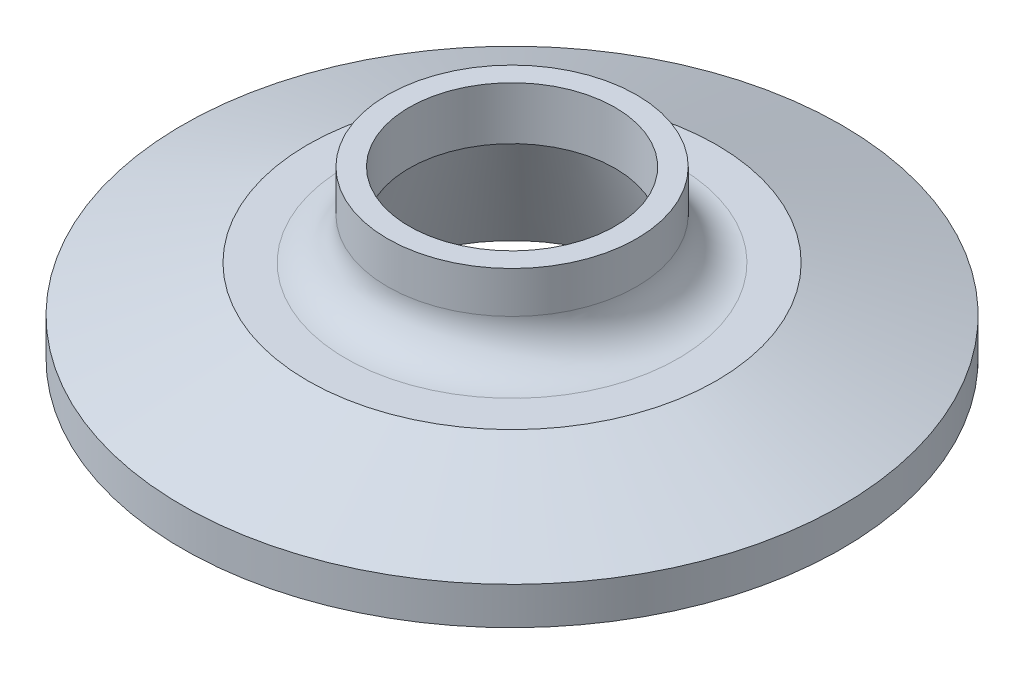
from build123d import *


with BuildPart() as part:
    # Sketch1 → Revolve1 (revolve)
    with BuildSketch(Plane.XY, mode=Mode.PRIVATE) as revolve1_sk:
        with BuildLine():
            Line((-9.525, 12.7), (-9.525, 9.525))
            ThreePointArc((-9.525, 9.525), (-10.45493597, 7.27993597), (-12.7, 6.35))
            Line((-12.7, 6.35), (-15.630196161, 6.35))
            Line((-15.630196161, 6.35), (-25.1968, 2.86804096))
            Line((-25.1968, 2.86804096), (-25.1968, 0))
            Line((-25.1968, 0), (-23.809172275, 0))
            ThreePointArc((-23.809172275, 0), (-23.374577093, 0.130798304), (-23.084366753, 0.479738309))
            Line((-23.084366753, 0.479738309), (-22.917498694, 0.872854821))
            ThreePointArc((-22.917498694, 0.872854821), (-21.8186, 1.6002), (-20.719701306, 0.872854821))
            Line((-20.719701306, 0.872854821), (-20.552833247, 0.479738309))
            ThreePointArc((-20.552833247, 0.479738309), (-20.262622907, 0.130798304), (-19.828027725, 0))
            Line((-19.828027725, 0), (-11.049, 0))
            Line((-11.049, 0), (-7.874, 8.666720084))
            Line((-7.874, 8.666720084), (-7.874, 12.7))
            Line((-7.874, 12.7), (-9.525, 12.7))
        make_face()
    revolve(revolve1_sk.sketch.rotate(Axis((0, 0, 0), (0, 1, 0)), 270), axis=Axis((0, 0, 0), (0, 1, 0)))


solid = part.part
